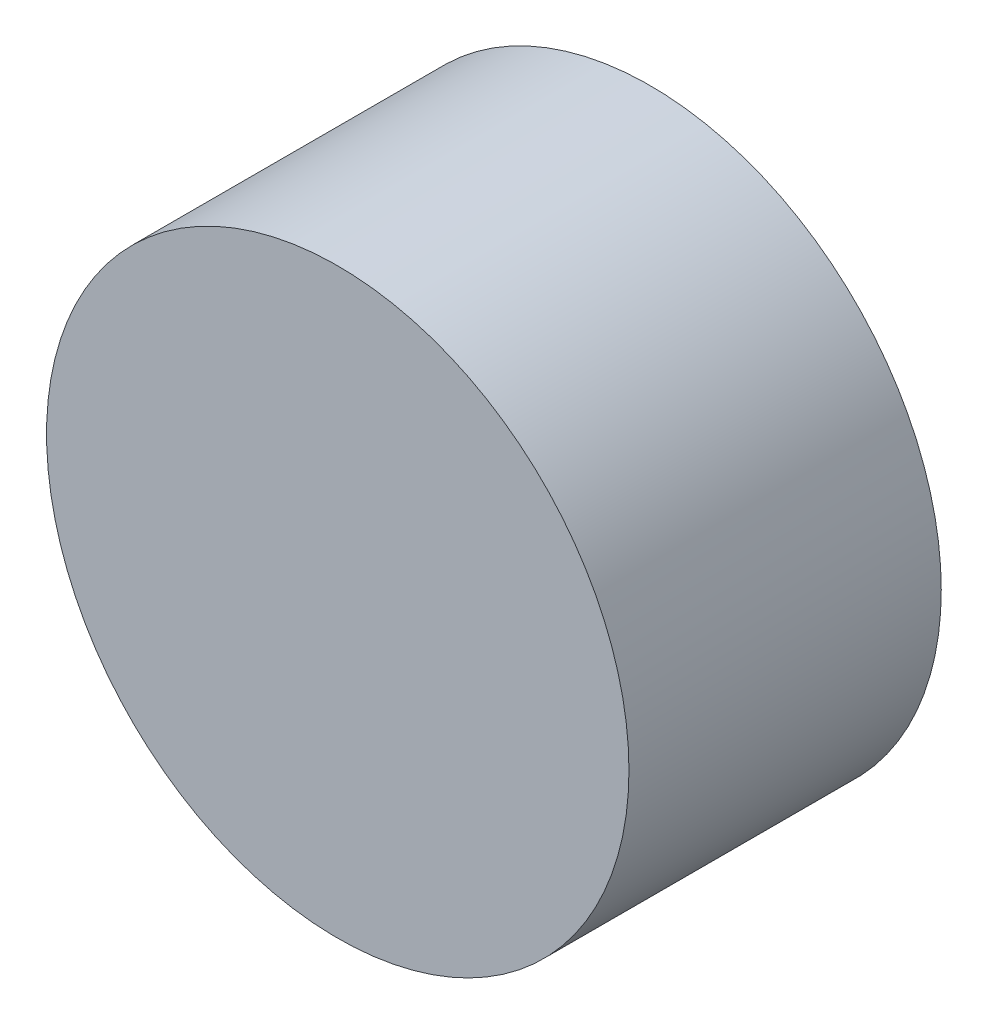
from build123d import *

# Parameters (mm, degrees)
SKETCH1_R      = 47.368158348
EXTRUDE1_DEPTH = 50.8


with BuildPart() as part:
    # Sketch1 → Extrude1 (new body)
    with BuildSketch(Plane.XY):
        Circle(SKETCH1_R)
    extrude(amount=EXTRUDE1_DEPTH)


solid = part.part
